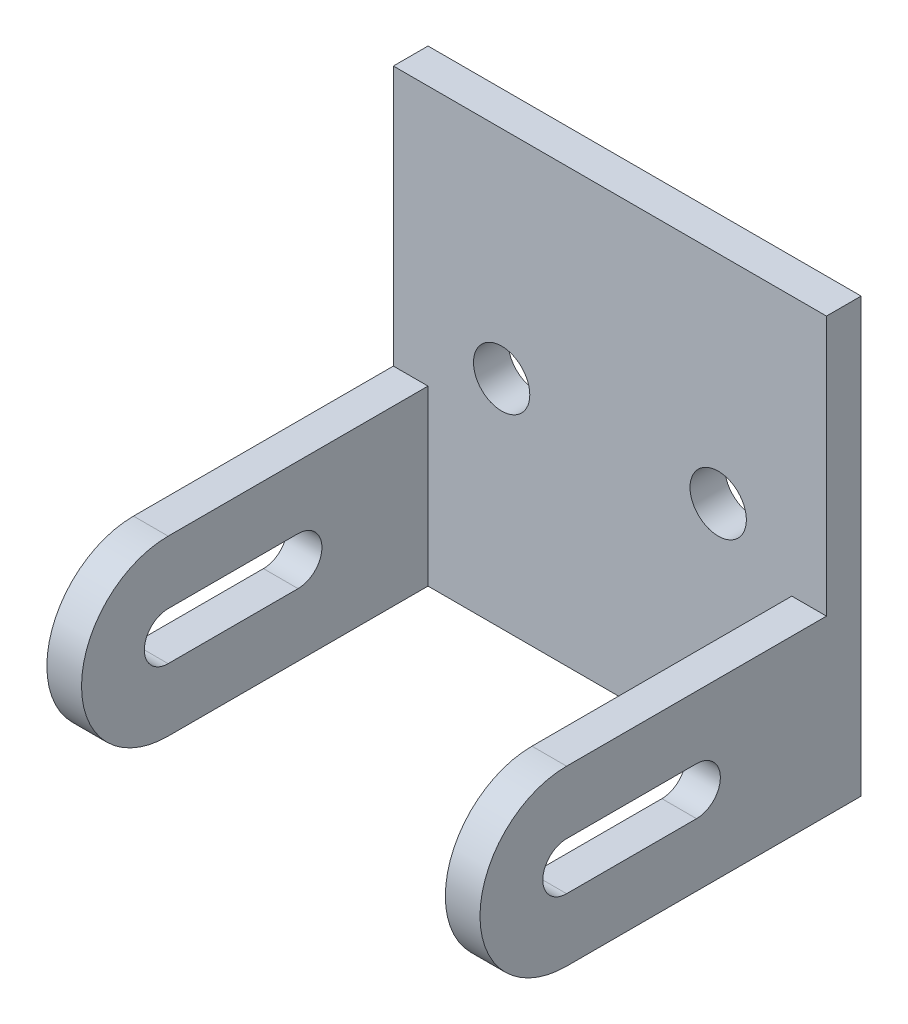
ISO-10303-21;
HEADER;
FILE_DESCRIPTION(('STEP AP214'),'2;1');
FILE_NAME('part.step','',(''),(''),'','','');
FILE_SCHEMA(('AUTOMOTIVE_DESIGN { 1 0 10303 214 1 1 1 1 }'));
ENDSEC;
DATA;
#1=APPLICATION_CONTEXT('core data for automotive mechanical design processes');
#2=APPLICATION_PROTOCOL_DEFINITION('international standard','automotive_design',2000,#1);
#3=PRODUCT_CONTEXT('',#1,'mechanical');
#4=PRODUCT('Part','Part','',(#3));
#5=PRODUCT_RELATED_PRODUCT_CATEGORY('part','',(#4));
#6=PRODUCT_DEFINITION_FORMATION('','',#4);
#7=PRODUCT_DEFINITION_CONTEXT('part definition',#1,'design');
#8=PRODUCT_DEFINITION('design','',#6,#7);
#9=PRODUCT_DEFINITION_SHAPE('','',#8);
#10=(LENGTH_UNIT() NAMED_UNIT(*) SI_UNIT(.MILLI.,.METRE.));
#11=(NAMED_UNIT(*) PLANE_ANGLE_UNIT() SI_UNIT($,.RADIAN.));
#12=(NAMED_UNIT(*) SI_UNIT($,.STERADIAN.) SOLID_ANGLE_UNIT());
#13=UNCERTAINTY_MEASURE_WITH_UNIT(LENGTH_MEASURE(1.E-05),#10,'distance_accuracy_value','');
#14=(GEOMETRIC_REPRESENTATION_CONTEXT(3) GLOBAL_UNCERTAINTY_ASSIGNED_CONTEXT((#13)) GLOBAL_UNIT_ASSIGNED_CONTEXT((#10,
#11,#12)) REPRESENTATION_CONTEXT('',''));
#15=CARTESIAN_POINT('',(0.,0.,0.));
#16=DIRECTION('',(0.,0.,1.));
#17=DIRECTION('',(1.,0.,0.));
#18=AXIS2_PLACEMENT_3D('',#15,#16,#17);
#19=CARTESIAN_POINT('',(0.,0.,4.));
#20=DIRECTION('',(0.,0.,1.));
#21=DIRECTION('',(1.,0.,0.));
#22=AXIS2_PLACEMENT_3D('',#19,#20,#21);
#23=PLANE('',#22);
#24=DIRECTION('',(1.,0.,0.));
#25=VECTOR('',#24,1.);
#26=CARTESIAN_POINT('',(46.,-30.,4.));
#27=LINE('',#26,#25);
#28=CARTESIAN_POINT('',(46.,-30.,4.));
#29=VERTEX_POINT('',#28);
#30=CARTESIAN_POINT('',(50.,-30.,4.));
#31=VERTEX_POINT('',#30);
#32=EDGE_CURVE('E252',#29,#31,#27,.T.);
#33=ORIENTED_EDGE('',*,*,#32,.T.);
#34=DIRECTION('',(0.,1.,0.));
#35=VECTOR('',#34,1.);
#36=CARTESIAN_POINT('',(50.,0.,4.));
#37=LINE('',#36,#35);
#38=CARTESIAN_POINT('',(50.,0.,4.));
#39=VERTEX_POINT('',#38);
#40=EDGE_CURVE('E358',#31,#39,#37,.T.);
#41=ORIENTED_EDGE('',*,*,#40,.T.);
#42=DIRECTION('',(-1.,0.,0.));
#43=VECTOR('',#42,1.);
#44=CARTESIAN_POINT('',(0.,0.,4.));
#45=LINE('',#44,#43);
#46=CARTESIAN_POINT('',(0.,0.,4.));
#47=VERTEX_POINT('',#46);
#48=EDGE_CURVE('E361',#39,#47,#45,.T.);
#49=ORIENTED_EDGE('',*,*,#48,.T.);
#50=DIRECTION('',(0.,-1.,0.));
#51=VECTOR('',#50,1.);
#52=CARTESIAN_POINT('',(0.,0.,4.));
#53=LINE('',#52,#51);
#54=CARTESIAN_POINT('',(0.,-30.,4.));
#55=VERTEX_POINT('',#54);
#56=EDGE_CURVE('E351',#47,#55,#53,.T.);
#57=ORIENTED_EDGE('',*,*,#56,.T.);
#58=DIRECTION('',(-1.,0.,0.));
#59=VECTOR('',#58,1.);
#60=CARTESIAN_POINT('',(4.,-30.,4.));
#61=LINE('',#60,#59);
#62=CARTESIAN_POINT('',(4.,-30.,4.));
#63=VERTEX_POINT('',#62);
#64=EDGE_CURVE('E325',#63,#55,#61,.T.);
#65=ORIENTED_EDGE('',*,*,#64,.F.);
#66=DIRECTION('',(0.,-1.,0.));
#67=VECTOR('',#66,1.);
#68=CARTESIAN_POINT('',(4.00000000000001,-50.,4.));
#69=LINE('',#68,#67);
#70=CARTESIAN_POINT('',(4.00000000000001,-50.,4.));
#71=VERTEX_POINT('',#70);
#72=EDGE_CURVE('E302',#63,#71,#69,.T.);
#73=ORIENTED_EDGE('',*,*,#72,.T.);
#74=DIRECTION('',(1.,0.,0.));
#75=VECTOR('',#74,1.);
#76=CARTESIAN_POINT('',(0.,-50.,4.));
#77=LINE('',#76,#75);
#78=CARTESIAN_POINT('',(46.,-50.,4.));
#79=VERTEX_POINT('',#78);
#80=EDGE_CURVE('E65',#71,#79,#77,.T.);
#81=ORIENTED_EDGE('',*,*,#80,.T.);
#82=DIRECTION('',(0.,1.,0.));
#83=VECTOR('',#82,1.);
#84=CARTESIAN_POINT('',(46.,-30.,4.));
#85=LINE('',#84,#83);
#86=EDGE_CURVE('E60',#79,#29,#85,.T.);
#87=ORIENTED_EDGE('',*,*,#86,.T.);
#88=EDGE_LOOP('',(#33,#41,#49,#57,#65,#73,#81,#87));
#89=FACE_BOUND('',#88,.T.);
#90=CARTESIAN_POINT('',(12.5,-25.,4.));
#91=DIRECTION('',(0.,0.,1.));
#92=DIRECTION('',(1.,0.,0.));
#93=AXIS2_PLACEMENT_3D('',#90,#91,#92);
#94=CIRCLE('',#93,3.25);
#95=CARTESIAN_POINT('',(15.75,-25.,4.));
#96=VERTEX_POINT('',#95);
#97=EDGE_CURVE('E343',#96,#96,#94,.T.);
#98=ORIENTED_EDGE('',*,*,#97,.F.);
#99=EDGE_LOOP('',(#98));
#100=FACE_BOUND('',#99,.T.);
#101=CARTESIAN_POINT('',(37.5,-25.,4.));
#102=DIRECTION('',(0.,0.,1.));
#103=DIRECTION('',(-1.,0.,0.));
#104=AXIS2_PLACEMENT_3D('',#101,#102,#103);
#105=CIRCLE('',#104,3.25);
#106=CARTESIAN_POINT('',(34.25,-25.,4.));
#107=VERTEX_POINT('',#106);
#108=EDGE_CURVE('E335',#107,#107,#105,.T.);
#109=ORIENTED_EDGE('',*,*,#108,.F.);
#110=EDGE_LOOP('',(#109));
#111=FACE_BOUND('',#110,.T.);
#112=ADVANCED_FACE('F44',(#89,#100,#111),#23,.T.);
#113=CARTESIAN_POINT('',(0.,0.,0.));
#114=DIRECTION('',(0.,0.,1.));
#115=DIRECTION('',(1.,0.,0.));
#116=AXIS2_PLACEMENT_3D('',#113,#114,#115);
#117=PLANE('',#116);
#118=DIRECTION('',(0.,-1.,0.));
#119=VECTOR('',#118,1.);
#120=CARTESIAN_POINT('',(0.,0.,0.));
#121=LINE('',#120,#119);
#122=CARTESIAN_POINT('',(0.,0.,0.));
#123=VERTEX_POINT('',#122);
#124=CARTESIAN_POINT('',(0.,-50.,0.));
#125=VERTEX_POINT('',#124);
#126=EDGE_CURVE('E347',#123,#125,#121,.T.);
#127=ORIENTED_EDGE('',*,*,#126,.F.);
#128=DIRECTION('',(-1.,0.,0.));
#129=VECTOR('',#128,1.);
#130=CARTESIAN_POINT('',(0.,0.,0.));
#131=LINE('',#130,#129);
#132=CARTESIAN_POINT('',(50.,0.,0.));
#133=VERTEX_POINT('',#132);
#134=EDGE_CURVE('E355',#133,#123,#131,.T.);
#135=ORIENTED_EDGE('',*,*,#134,.F.);
#136=DIRECTION('',(0.,1.,0.));
#137=VECTOR('',#136,1.);
#138=CARTESIAN_POINT('',(50.,0.,0.));
#139=LINE('',#138,#137);
#140=CARTESIAN_POINT('',(50.,-50.,0.));
#141=VERTEX_POINT('',#140);
#142=EDGE_CURVE('E371',#141,#133,#139,.T.);
#143=ORIENTED_EDGE('',*,*,#142,.F.);
#144=DIRECTION('',(1.,0.,0.));
#145=VECTOR('',#144,1.);
#146=CARTESIAN_POINT('',(0.,-50.,0.));
#147=LINE('',#146,#145);
#148=EDGE_CURVE('E368',#125,#141,#147,.T.);
#149=ORIENTED_EDGE('',*,*,#148,.F.);
#150=EDGE_LOOP('',(#127,#135,#143,#149));
#151=FACE_BOUND('',#150,.T.);
#152=CARTESIAN_POINT('',(12.5,-25.,0.));
#153=DIRECTION('',(0.,0.,1.));
#154=DIRECTION('',(1.,0.,0.));
#155=AXIS2_PLACEMENT_3D('',#152,#153,#154);
#156=CIRCLE('',#155,3.25);
#157=CARTESIAN_POINT('',(15.75,-25.,0.));
#158=VERTEX_POINT('',#157);
#159=EDGE_CURVE('E339',#158,#158,#156,.T.);
#160=ORIENTED_EDGE('',*,*,#159,.T.);
#161=EDGE_LOOP('',(#160));
#162=FACE_BOUND('',#161,.T.);
#163=CARTESIAN_POINT('',(37.5,-25.,0.));
#164=DIRECTION('',(0.,0.,1.));
#165=DIRECTION('',(-1.,0.,0.));
#166=AXIS2_PLACEMENT_3D('',#163,#164,#165);
#167=CIRCLE('',#166,3.25);
#168=CARTESIAN_POINT('',(34.25,-25.,0.));
#169=VERTEX_POINT('',#168);
#170=EDGE_CURVE('E328',#169,#169,#167,.T.);
#171=ORIENTED_EDGE('',*,*,#170,.T.);
#172=EDGE_LOOP('',(#171));
#173=FACE_BOUND('',#172,.T.);
#174=ADVANCED_FACE('F394',(#151,#162,#173),#117,.F.);
#175=CARTESIAN_POINT('',(0.,0.,4.));
#176=DIRECTION('',(1.,0.,0.));
#177=DIRECTION('',(0.,0.,-1.));
#178=AXIS2_PLACEMENT_3D('',#175,#176,#177);
#179=PLANE('',#178);
#180=ORIENTED_EDGE('',*,*,#126,.T.);
#181=DIRECTION('',(0.,0.,-1.));
#182=VECTOR('',#181,1.);
#183=CARTESIAN_POINT('',(0.,-50.,4.));
#184=LINE('',#183,#182);
#185=CARTESIAN_POINT('',(0.,-50.,34.));
#186=VERTEX_POINT('',#185);
#187=EDGE_CURVE('E11',#186,#125,#184,.T.);
#188=ORIENTED_EDGE('',*,*,#187,.F.);
#189=CARTESIAN_POINT('',(0.,-40.,34.));
#190=DIRECTION('',(-1.,0.,0.));
#191=DIRECTION('',(0.,-1.,0.));
#192=AXIS2_PLACEMENT_3D('',#189,#190,#191);
#193=CIRCLE('',#192,10.);
#194=CARTESIAN_POINT('',(0.,-30.,34.));
#195=VERTEX_POINT('',#194);
#196=EDGE_CURVE('E292',#186,#195,#193,.T.);
#197=ORIENTED_EDGE('',*,*,#196,.T.);
#198=DIRECTION('',(0.,0.,-1.));
#199=VECTOR('',#198,1.);
#200=CARTESIAN_POINT('',(0.,-30.,4.));
#201=LINE('',#200,#199);
#202=EDGE_CURVE('E306',#195,#55,#201,.T.);
#203=ORIENTED_EDGE('',*,*,#202,.T.);
#204=ORIENTED_EDGE('',*,*,#56,.F.);
#205=DIRECTION('',(0.,0.,-1.));
#206=VECTOR('',#205,1.);
#207=CARTESIAN_POINT('',(0.,0.,4.));
#208=LINE('',#207,#206);
#209=EDGE_CURVE('E364',#47,#123,#208,.T.);
#210=ORIENTED_EDGE('',*,*,#209,.T.);
#211=EDGE_LOOP('',(#180,#188,#197,#203,#204,#210));
#212=FACE_BOUND('',#211,.T.);
#213=CARTESIAN_POINT('',(0.,-40.,34.));
#214=DIRECTION('',(-1.,0.,0.));
#215=DIRECTION('',(0.,-1.,0.));
#216=AXIS2_PLACEMENT_3D('',#213,#214,#215);
#217=CIRCLE('',#216,2.75);
#218=CARTESIAN_POINT('',(0.,-42.75,34.));
#219=VERTEX_POINT('',#218);
#220=CARTESIAN_POINT('',(0.,-37.25,34.));
#221=VERTEX_POINT('',#220);
#222=EDGE_CURVE('E251',#219,#221,#217,.T.);
#223=ORIENTED_EDGE('',*,*,#222,.F.);
#224=DIRECTION('',(0.,0.,1.));
#225=VECTOR('',#224,1.);
#226=CARTESIAN_POINT('',(0.,-42.75,34.));
#227=LINE('',#226,#225);
#228=CARTESIAN_POINT('',(0.,-42.75,19.));
#229=VERTEX_POINT('',#228);
#230=EDGE_CURVE('E263',#229,#219,#227,.T.);
#231=ORIENTED_EDGE('',*,*,#230,.F.);
#232=CARTESIAN_POINT('',(0.,-40.,19.));
#233=DIRECTION('',(-1.,0.,0.));
#234=DIRECTION('',(0.,-1.,0.));
#235=AXIS2_PLACEMENT_3D('',#232,#233,#234);
#236=CIRCLE('',#235,2.75);
#237=CARTESIAN_POINT('',(0.,-37.25,19.));
#238=VERTEX_POINT('',#237);
#239=EDGE_CURVE('E282',#238,#229,#236,.T.);
#240=ORIENTED_EDGE('',*,*,#239,.F.);
#241=DIRECTION('',(0.,0.,-1.));
#242=VECTOR('',#241,1.);
#243=CARTESIAN_POINT('',(0.,-37.25,34.));
#244=LINE('',#243,#242);
#245=EDGE_CURVE('E278',#221,#238,#244,.T.);
#246=ORIENTED_EDGE('',*,*,#245,.F.);
#247=EDGE_LOOP('',(#223,#231,#240,#246));
#248=FACE_BOUND('',#247,.T.);
#249=ADVANCED_FACE('F46',(#212,#248),#179,.F.);
#250=CARTESIAN_POINT('',(0.,-50.,4.));
#251=DIRECTION('',(0.,1.,0.));
#252=DIRECTION('',(-1.,0.,0.));
#253=AXIS2_PLACEMENT_3D('',#250,#251,#252);
#254=PLANE('',#253);
#255=ORIENTED_EDGE('',*,*,#148,.T.);
#256=DIRECTION('',(0.,0.,-1.));
#257=VECTOR('',#256,1.);
#258=CARTESIAN_POINT('',(50.,-50.,4.));
#259=LINE('',#258,#257);
#260=CARTESIAN_POINT('',(50.,-50.,34.));
#261=VERTEX_POINT('',#260);
#262=EDGE_CURVE('E53',#261,#141,#259,.T.);
#263=ORIENTED_EDGE('',*,*,#262,.F.);
#264=DIRECTION('',(1.,0.,0.));
#265=VECTOR('',#264,1.);
#266=CARTESIAN_POINT('',(46.,-50.,34.));
#267=LINE('',#266,#265);
#268=CARTESIAN_POINT('',(46.,-50.,34.));
#269=VERTEX_POINT('',#268);
#270=EDGE_CURVE('E241',#269,#261,#267,.T.);
#271=ORIENTED_EDGE('',*,*,#270,.F.);
#272=DIRECTION('',(0.,0.,-1.));
#273=VECTOR('',#272,1.);
#274=CARTESIAN_POINT('',(46.,-50.,4.));
#275=LINE('',#274,#273);
#276=EDGE_CURVE('E230',#269,#79,#275,.T.);
#277=ORIENTED_EDGE('',*,*,#276,.T.);
#278=ORIENTED_EDGE('',*,*,#80,.F.);
#279=DIRECTION('',(0.,0.,1.));
#280=VECTOR('',#279,1.);
#281=CARTESIAN_POINT('',(4.00000000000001,-50.,4.));
#282=LINE('',#281,#280);
#283=CARTESIAN_POINT('',(4.00000000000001,-50.,34.));
#284=VERTEX_POINT('',#283);
#285=EDGE_CURVE('E305',#71,#284,#282,.T.);
#286=ORIENTED_EDGE('',*,*,#285,.T.);
#287=DIRECTION('',(-1.,0.,0.));
#288=VECTOR('',#287,1.);
#289=CARTESIAN_POINT('',(4.00000000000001,-50.,34.));
#290=LINE('',#289,#288);
#291=EDGE_CURVE('E318',#284,#186,#290,.T.);
#292=ORIENTED_EDGE('',*,*,#291,.T.);
#293=ORIENTED_EDGE('',*,*,#187,.T.);
#294=EDGE_LOOP('',(#255,#263,#271,#277,#278,#286,#292,#293));
#295=FACE_BOUND('',#294,.T.);
#296=ADVANCED_FACE('F414',(#295),#254,.F.);
#297=CARTESIAN_POINT('',(50.,0.,4.));
#298=DIRECTION('',(-1.,0.,0.));
#299=DIRECTION('',(0.,-1.,0.));
#300=AXIS2_PLACEMENT_3D('',#297,#298,#299);
#301=PLANE('',#300);
#302=ORIENTED_EDGE('',*,*,#142,.T.);
#303=DIRECTION('',(0.,0.,-1.));
#304=VECTOR('',#303,1.);
#305=CARTESIAN_POINT('',(50.,0.,4.));
#306=LINE('',#305,#304);
#307=EDGE_CURVE('E379',#39,#133,#306,.T.);
#308=ORIENTED_EDGE('',*,*,#307,.F.);
#309=ORIENTED_EDGE('',*,*,#40,.F.);
#310=DIRECTION('',(0.,0.,1.));
#311=VECTOR('',#310,1.);
#312=CARTESIAN_POINT('',(50.,-30.,34.));
#313=LINE('',#312,#311);
#314=CARTESIAN_POINT('',(50.,-30.,34.));
#315=VERTEX_POINT('',#314);
#316=EDGE_CURVE('E231',#31,#315,#313,.T.);
#317=ORIENTED_EDGE('',*,*,#316,.T.);
#318=CARTESIAN_POINT('',(50.,-40.,34.));
#319=DIRECTION('',(1.,0.,0.));
#320=DIRECTION('',(0.,-1.,0.));
#321=AXIS2_PLACEMENT_3D('',#318,#319,#320);
#322=CIRCLE('',#321,10.);
#323=EDGE_CURVE('E220',#315,#261,#322,.T.);
#324=ORIENTED_EDGE('',*,*,#323,.T.);
#325=ORIENTED_EDGE('',*,*,#262,.T.);
#326=EDGE_LOOP('',(#302,#308,#309,#317,#324,#325));
#327=FACE_BOUND('',#326,.T.);
#328=DIRECTION('',(0.,0.,-1.));
#329=VECTOR('',#328,1.);
#330=CARTESIAN_POINT('',(50.,-42.75,34.));
#331=LINE('',#330,#329);
#332=CARTESIAN_POINT('',(50.,-42.75,34.));
#333=VERTEX_POINT('',#332);
#334=CARTESIAN_POINT('',(50.,-42.75,19.));
#335=VERTEX_POINT('',#334);
#336=EDGE_CURVE('E211',#333,#335,#331,.T.);
#337=ORIENTED_EDGE('',*,*,#336,.F.);
#338=CARTESIAN_POINT('',(50.,-40.,34.));
#339=DIRECTION('',(1.,0.,0.));
#340=DIRECTION('',(0.,1.,0.));
#341=AXIS2_PLACEMENT_3D('',#338,#339,#340);
#342=CIRCLE('',#341,2.75000000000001);
#343=CARTESIAN_POINT('',(50.,-37.25,34.));
#344=VERTEX_POINT('',#343);
#345=EDGE_CURVE('E177',#344,#333,#342,.T.);
#346=ORIENTED_EDGE('',*,*,#345,.F.);
#347=DIRECTION('',(0.,0.,1.));
#348=VECTOR('',#347,1.);
#349=CARTESIAN_POINT('',(50.,-37.25,34.));
#350=LINE('',#349,#348);
#351=CARTESIAN_POINT('',(50.,-37.25,19.));
#352=VERTEX_POINT('',#351);
#353=EDGE_CURVE('E198',#352,#344,#350,.T.);
#354=ORIENTED_EDGE('',*,*,#353,.F.);
#355=CARTESIAN_POINT('',(50.,-40.,19.));
#356=DIRECTION('',(1.,0.,0.));
#357=DIRECTION('',(0.,1.,0.));
#358=AXIS2_PLACEMENT_3D('',#355,#356,#357);
#359=CIRCLE('',#358,2.75000000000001);
#360=EDGE_CURVE('E202',#335,#352,#359,.T.);
#361=ORIENTED_EDGE('',*,*,#360,.F.);
#362=EDGE_LOOP('',(#337,#346,#354,#361));
#363=FACE_BOUND('',#362,.T.);
#364=ADVANCED_FACE('F386',(#327,#363),#301,.F.);
#365=CARTESIAN_POINT('',(0.,0.,4.));
#366=DIRECTION('',(0.,-1.,0.));
#367=DIRECTION('',(0.,0.,-1.));
#368=AXIS2_PLACEMENT_3D('',#365,#366,#367);
#369=PLANE('',#368);
#370=ORIENTED_EDGE('',*,*,#134,.T.);
#371=ORIENTED_EDGE('',*,*,#209,.F.);
#372=ORIENTED_EDGE('',*,*,#48,.F.);
#373=ORIENTED_EDGE('',*,*,#307,.T.);
#374=EDGE_LOOP('',(#370,#371,#372,#373));
#375=FACE_BOUND('',#374,.T.);
#376=ADVANCED_FACE('F398',(#375),#369,.F.);
#377=CARTESIAN_POINT('',(12.5,-25.,4.));
#378=DIRECTION('',(0.,0.,-1.));
#379=DIRECTION('',(-1.,0.,0.));
#380=AXIS2_PLACEMENT_3D('',#377,#378,#379);
#381=CYLINDRICAL_SURFACE('',#380,3.25);
#382=ORIENTED_EDGE('',*,*,#97,.T.);
#383=EDGE_LOOP('',(#382));
#384=FACE_BOUND('',#383,.T.);
#385=ORIENTED_EDGE('',*,*,#159,.F.);
#386=EDGE_LOOP('',(#385));
#387=FACE_BOUND('',#386,.T.);
#388=ADVANCED_FACE('F431',(#384,#387),#381,.F.);
#389=CARTESIAN_POINT('',(37.5,-25.,4.));
#390=DIRECTION('',(0.,0.,-1.));
#391=DIRECTION('',(-1.,0.,0.));
#392=AXIS2_PLACEMENT_3D('',#389,#390,#391);
#393=CYLINDRICAL_SURFACE('',#392,3.25);
#394=ORIENTED_EDGE('',*,*,#108,.T.);
#395=EDGE_LOOP('',(#394));
#396=FACE_BOUND('',#395,.T.);
#397=ORIENTED_EDGE('',*,*,#170,.F.);
#398=EDGE_LOOP('',(#397));
#399=FACE_BOUND('',#398,.T.);
#400=ADVANCED_FACE('F468',(#396,#399),#393,.F.);
#401=CARTESIAN_POINT('',(4.,-30.,4.));
#402=DIRECTION('',(0.,1.,0.));
#403=DIRECTION('',(-1.,0.,0.));
#404=AXIS2_PLACEMENT_3D('',#401,#402,#403);
#405=PLANE('',#404);
#406=ORIENTED_EDGE('',*,*,#202,.F.);
#407=DIRECTION('',(-1.,0.,0.));
#408=VECTOR('',#407,1.);
#409=CARTESIAN_POINT('',(4.,-30.,34.));
#410=LINE('',#409,#408);
#411=CARTESIAN_POINT('',(4.,-30.,34.));
#412=VERTEX_POINT('',#411);
#413=EDGE_CURVE('E329',#412,#195,#410,.T.);
#414=ORIENTED_EDGE('',*,*,#413,.F.);
#415=DIRECTION('',(0.,0.,-1.));
#416=VECTOR('',#415,1.);
#417=CARTESIAN_POINT('',(4.,-30.,4.));
#418=LINE('',#417,#416);
#419=EDGE_CURVE('E314',#412,#63,#418,.T.);
#420=ORIENTED_EDGE('',*,*,#419,.T.);
#421=ORIENTED_EDGE('',*,*,#64,.T.);
#422=EDGE_LOOP('',(#406,#414,#420,#421));
#423=FACE_BOUND('',#422,.T.);
#424=ADVANCED_FACE('F477',(#423),#405,.T.);
#425=CARTESIAN_POINT('',(4.00000000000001,-40.,34.));
#426=DIRECTION('',(-1.,0.,0.));
#427=DIRECTION('',(0.,-1.,0.));
#428=AXIS2_PLACEMENT_3D('',#425,#426,#427);
#429=CYLINDRICAL_SURFACE('',#428,10.);
#430=ORIENTED_EDGE('',*,*,#196,.F.);
#431=ORIENTED_EDGE('',*,*,#291,.F.);
#432=CARTESIAN_POINT('',(4.00000000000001,-40.,34.));
#433=DIRECTION('',(-1.,0.,0.));
#434=DIRECTION('',(0.,-1.,0.));
#435=AXIS2_PLACEMENT_3D('',#432,#433,#434);
#436=CIRCLE('',#435,10.);
#437=EDGE_CURVE('E310',#284,#412,#436,.T.);
#438=ORIENTED_EDGE('',*,*,#437,.T.);
#439=ORIENTED_EDGE('',*,*,#413,.T.);
#440=EDGE_LOOP('',(#430,#431,#438,#439));
#441=FACE_BOUND('',#440,.T.);
#442=ADVANCED_FACE('F486',(#441),#429,.T.);
#443=CARTESIAN_POINT('',(4.00000000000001,-40.,34.));
#444=DIRECTION('',(-1.,0.,0.));
#445=DIRECTION('',(0.,-1.,0.));
#446=AXIS2_PLACEMENT_3D('',#443,#444,#445);
#447=PLANE('',#446);
#448=DIRECTION('',(0.,0.,1.));
#449=VECTOR('',#448,1.);
#450=CARTESIAN_POINT('',(4.00000000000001,-42.75,34.));
#451=LINE('',#450,#449);
#452=CARTESIAN_POINT('',(4.00000000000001,-42.75,19.));
#453=VERTEX_POINT('',#452);
#454=CARTESIAN_POINT('',(4.00000000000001,-42.75,34.));
#455=VERTEX_POINT('',#454);
#456=EDGE_CURVE('E271',#453,#455,#451,.T.);
#457=ORIENTED_EDGE('',*,*,#456,.T.);
#458=CARTESIAN_POINT('',(4.00000000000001,-40.,34.));
#459=DIRECTION('',(-1.,0.,0.));
#460=DIRECTION('',(0.,-1.,0.));
#461=AXIS2_PLACEMENT_3D('',#458,#459,#460);
#462=CIRCLE('',#461,2.75);
#463=CARTESIAN_POINT('',(4.,-37.25,34.));
#464=VERTEX_POINT('',#463);
#465=EDGE_CURVE('E258',#455,#464,#462,.T.);
#466=ORIENTED_EDGE('',*,*,#465,.T.);
#467=DIRECTION('',(0.,0.,-1.));
#468=VECTOR('',#467,1.);
#469=CARTESIAN_POINT('',(4.,-37.25,34.));
#470=LINE('',#469,#468);
#471=CARTESIAN_POINT('',(4.00000000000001,-37.25,19.));
#472=VERTEX_POINT('',#471);
#473=EDGE_CURVE('E262',#464,#472,#470,.T.);
#474=ORIENTED_EDGE('',*,*,#473,.T.);
#475=CARTESIAN_POINT('',(4.00000000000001,-40.,19.));
#476=DIRECTION('',(-1.,0.,0.));
#477=DIRECTION('',(0.,-1.,0.));
#478=AXIS2_PLACEMENT_3D('',#475,#476,#477);
#479=CIRCLE('',#478,2.75);
#480=EDGE_CURVE('E267',#472,#453,#479,.T.);
#481=ORIENTED_EDGE('',*,*,#480,.T.);
#482=EDGE_LOOP('',(#457,#466,#474,#481));
#483=FACE_BOUND('',#482,.T.);
#484=ORIENTED_EDGE('',*,*,#72,.F.);
#485=ORIENTED_EDGE('',*,*,#419,.F.);
#486=ORIENTED_EDGE('',*,*,#437,.F.);
#487=ORIENTED_EDGE('',*,*,#285,.F.);
#488=EDGE_LOOP('',(#484,#485,#486,#487));
#489=FACE_BOUND('',#488,.T.);
#490=ADVANCED_FACE('F494',(#483,#489),#447,.F.);
#491=CARTESIAN_POINT('',(4.00000000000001,-40.,34.));
#492=DIRECTION('',(-1.,0.,0.));
#493=DIRECTION('',(0.,-1.,0.));
#494=AXIS2_PLACEMENT_3D('',#491,#492,#493);
#495=CYLINDRICAL_SURFACE('',#494,2.75);
#496=ORIENTED_EDGE('',*,*,#222,.T.);
#497=DIRECTION('',(-1.,0.,0.));
#498=VECTOR('',#497,1.);
#499=CARTESIAN_POINT('',(4.,-37.25,34.));
#500=LINE('',#499,#498);
#501=EDGE_CURVE('E275',#464,#221,#500,.T.);
#502=ORIENTED_EDGE('',*,*,#501,.F.);
#503=ORIENTED_EDGE('',*,*,#465,.F.);
#504=DIRECTION('',(-1.,0.,0.));
#505=VECTOR('',#504,1.);
#506=CARTESIAN_POINT('',(4.00000000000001,-42.75,34.));
#507=LINE('',#506,#505);
#508=EDGE_CURVE('E289',#455,#219,#507,.T.);
#509=ORIENTED_EDGE('',*,*,#508,.T.);
#510=EDGE_LOOP('',(#496,#502,#503,#509));
#511=FACE_BOUND('',#510,.T.);
#512=ADVANCED_FACE('F502',(#511),#495,.F.);
#513=CARTESIAN_POINT('',(4.00000000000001,-42.75,34.));
#514=DIRECTION('',(0.,-1.,0.));
#515=DIRECTION('',(1.,0.,0.));
#516=AXIS2_PLACEMENT_3D('',#513,#514,#515);
#517=PLANE('',#516);
#518=ORIENTED_EDGE('',*,*,#230,.T.);
#519=ORIENTED_EDGE('',*,*,#508,.F.);
#520=ORIENTED_EDGE('',*,*,#456,.F.);
#521=DIRECTION('',(-1.,0.,0.));
#522=VECTOR('',#521,1.);
#523=CARTESIAN_POINT('',(4.00000000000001,-42.75,19.));
#524=LINE('',#523,#522);
#525=EDGE_CURVE('E293',#453,#229,#524,.T.);
#526=ORIENTED_EDGE('',*,*,#525,.T.);
#527=EDGE_LOOP('',(#518,#519,#520,#526));
#528=FACE_BOUND('',#527,.T.);
#529=ADVANCED_FACE('F510',(#528),#517,.F.);
#530=CARTESIAN_POINT('',(4.00000000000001,-40.,19.));
#531=DIRECTION('',(-1.,0.,0.));
#532=DIRECTION('',(0.,-1.,0.));
#533=AXIS2_PLACEMENT_3D('',#530,#531,#532);
#534=CYLINDRICAL_SURFACE('',#533,2.75);
#535=ORIENTED_EDGE('',*,*,#239,.T.);
#536=ORIENTED_EDGE('',*,*,#525,.F.);
#537=ORIENTED_EDGE('',*,*,#480,.F.);
#538=DIRECTION('',(-1.,0.,0.));
#539=VECTOR('',#538,1.);
#540=CARTESIAN_POINT('',(4.,-37.25,19.));
#541=LINE('',#540,#539);
#542=EDGE_CURVE('E296',#472,#238,#541,.T.);
#543=ORIENTED_EDGE('',*,*,#542,.T.);
#544=EDGE_LOOP('',(#535,#536,#537,#543));
#545=FACE_BOUND('',#544,.T.);
#546=ADVANCED_FACE('F518',(#545),#534,.F.);
#547=CARTESIAN_POINT('',(4.,-37.25,34.));
#548=DIRECTION('',(0.,1.,0.));
#549=DIRECTION('',(0.,0.,1.));
#550=AXIS2_PLACEMENT_3D('',#547,#548,#549);
#551=PLANE('',#550);
#552=ORIENTED_EDGE('',*,*,#245,.T.);
#553=ORIENTED_EDGE('',*,*,#542,.F.);
#554=ORIENTED_EDGE('',*,*,#473,.F.);
#555=ORIENTED_EDGE('',*,*,#501,.T.);
#556=EDGE_LOOP('',(#552,#553,#554,#555));
#557=FACE_BOUND('',#556,.T.);
#558=ADVANCED_FACE('F526',(#557),#551,.F.);
#559=CARTESIAN_POINT('',(46.,-40.,34.));
#560=DIRECTION('',(1.,0.,0.));
#561=DIRECTION('',(0.,1.,0.));
#562=AXIS2_PLACEMENT_3D('',#559,#560,#561);
#563=CYLINDRICAL_SURFACE('',#562,10.);
#564=ORIENTED_EDGE('',*,*,#323,.F.);
#565=DIRECTION('',(1.,0.,0.));
#566=VECTOR('',#565,1.);
#567=CARTESIAN_POINT('',(46.,-30.,34.));
#568=LINE('',#567,#566);
#569=CARTESIAN_POINT('',(46.,-30.,34.));
#570=VERTEX_POINT('',#569);
#571=EDGE_CURVE('E248',#570,#315,#568,.T.);
#572=ORIENTED_EDGE('',*,*,#571,.F.);
#573=CARTESIAN_POINT('',(46.,-40.,34.));
#574=DIRECTION('',(1.,0.,0.));
#575=DIRECTION('',(0.,-1.,0.));
#576=AXIS2_PLACEMENT_3D('',#573,#574,#575);
#577=CIRCLE('',#576,10.);
#578=EDGE_CURVE('E226',#570,#269,#577,.T.);
#579=ORIENTED_EDGE('',*,*,#578,.T.);
#580=ORIENTED_EDGE('',*,*,#270,.T.);
#581=EDGE_LOOP('',(#564,#572,#579,#580));
#582=FACE_BOUND('',#581,.T.);
#583=ADVANCED_FACE('F412',(#582),#563,.T.);
#584=CARTESIAN_POINT('',(46.,-30.,34.));
#585=DIRECTION('',(0.,1.,0.));
#586=DIRECTION('',(-1.,0.,0.));
#587=AXIS2_PLACEMENT_3D('',#584,#585,#586);
#588=PLANE('',#587);
#589=ORIENTED_EDGE('',*,*,#316,.F.);
#590=ORIENTED_EDGE('',*,*,#32,.F.);
#591=DIRECTION('',(0.,0.,1.));
#592=VECTOR('',#591,1.);
#593=CARTESIAN_POINT('',(46.,-30.,34.));
#594=LINE('',#593,#592);
#595=EDGE_CURVE('E237',#29,#570,#594,.T.);
#596=ORIENTED_EDGE('',*,*,#595,.T.);
#597=ORIENTED_EDGE('',*,*,#571,.T.);
#598=EDGE_LOOP('',(#589,#590,#596,#597));
#599=FACE_BOUND('',#598,.T.);
#600=ADVANCED_FACE('F408',(#599),#588,.T.);
#601=CARTESIAN_POINT('',(46.,-40.,34.));
#602=DIRECTION('',(-1.,0.,0.));
#603=DIRECTION('',(0.,-1.,0.));
#604=AXIS2_PLACEMENT_3D('',#601,#602,#603);
#605=PLANE('',#604);
#606=CARTESIAN_POINT('',(46.,-40.,34.));
#607=DIRECTION('',(1.,0.,0.));
#608=DIRECTION('',(0.,1.,0.));
#609=AXIS2_PLACEMENT_3D('',#606,#607,#608);
#610=CIRCLE('',#609,2.75000000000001);
#611=CARTESIAN_POINT('',(46.,-37.25,34.));
#612=VERTEX_POINT('',#611);
#613=CARTESIAN_POINT('',(46.,-42.75,34.));
#614=VERTEX_POINT('',#613);
#615=EDGE_CURVE('E174',#612,#614,#610,.T.);
#616=ORIENTED_EDGE('',*,*,#615,.T.);
#617=DIRECTION('',(0.,0.,-1.));
#618=VECTOR('',#617,1.);
#619=CARTESIAN_POINT('',(46.,-42.75,34.));
#620=LINE('',#619,#618);
#621=CARTESIAN_POINT('',(46.,-42.75,19.));
#622=VERTEX_POINT('',#621);
#623=EDGE_CURVE('E187',#614,#622,#620,.T.);
#624=ORIENTED_EDGE('',*,*,#623,.T.);
#625=CARTESIAN_POINT('',(46.,-40.,19.));
#626=DIRECTION('',(1.,0.,0.));
#627=DIRECTION('',(0.,1.,0.));
#628=AXIS2_PLACEMENT_3D('',#625,#626,#627);
#629=CIRCLE('',#628,2.75000000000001);
#630=CARTESIAN_POINT('',(46.,-37.25,19.));
#631=VERTEX_POINT('',#630);
#632=EDGE_CURVE('E192',#622,#631,#629,.T.);
#633=ORIENTED_EDGE('',*,*,#632,.T.);
#634=DIRECTION('',(0.,0.,1.));
#635=VECTOR('',#634,1.);
#636=CARTESIAN_POINT('',(46.,-37.25,34.));
#637=LINE('',#636,#635);
#638=EDGE_CURVE('E183',#631,#612,#637,.T.);
#639=ORIENTED_EDGE('',*,*,#638,.T.);
#640=EDGE_LOOP('',(#616,#624,#633,#639));
#641=FACE_BOUND('',#640,.T.);
#642=ORIENTED_EDGE('',*,*,#578,.F.);
#643=ORIENTED_EDGE('',*,*,#595,.F.);
#644=ORIENTED_EDGE('',*,*,#86,.F.);
#645=ORIENTED_EDGE('',*,*,#276,.F.);
#646=EDGE_LOOP('',(#642,#643,#644,#645));
#647=FACE_BOUND('',#646,.T.);
#648=ADVANCED_FACE('F194',(#641,#647),#605,.T.);
#649=CARTESIAN_POINT('',(46.,-40.,34.));
#650=DIRECTION('',(1.,0.,0.));
#651=DIRECTION('',(0.,1.,0.));
#652=AXIS2_PLACEMENT_3D('',#649,#650,#651);
#653=CYLINDRICAL_SURFACE('',#652,2.75000000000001);
#654=ORIENTED_EDGE('',*,*,#345,.T.);
#655=DIRECTION('',(1.,0.,0.));
#656=VECTOR('',#655,1.);
#657=CARTESIAN_POINT('',(46.,-42.75,34.));
#658=LINE('',#657,#656);
#659=EDGE_CURVE('E170',#614,#333,#658,.T.);
#660=ORIENTED_EDGE('',*,*,#659,.F.);
#661=ORIENTED_EDGE('',*,*,#615,.F.);
#662=DIRECTION('',(1.,0.,0.));
#663=VECTOR('',#662,1.);
#664=CARTESIAN_POINT('',(46.,-37.25,34.));
#665=LINE('',#664,#663);
#666=EDGE_CURVE('E217',#612,#344,#665,.T.);
#667=ORIENTED_EDGE('',*,*,#666,.T.);
#668=EDGE_LOOP('',(#654,#660,#661,#667));
#669=FACE_BOUND('',#668,.T.);
#670=ADVANCED_FACE('F172',(#669),#653,.F.);
#671=CARTESIAN_POINT('',(46.,-37.25,34.));
#672=DIRECTION('',(0.,1.,0.));
#673=DIRECTION('',(-1.,0.,0.));
#674=AXIS2_PLACEMENT_3D('',#671,#672,#673);
#675=PLANE('',#674);
#676=ORIENTED_EDGE('',*,*,#353,.T.);
#677=ORIENTED_EDGE('',*,*,#666,.F.);
#678=ORIENTED_EDGE('',*,*,#638,.F.);
#679=DIRECTION('',(1.,0.,0.));
#680=VECTOR('',#679,1.);
#681=CARTESIAN_POINT('',(46.,-37.25,19.));
#682=LINE('',#681,#680);
#683=EDGE_CURVE('E221',#631,#352,#682,.T.);
#684=ORIENTED_EDGE('',*,*,#683,.T.);
#685=EDGE_LOOP('',(#676,#677,#678,#684));
#686=FACE_BOUND('',#685,.T.);
#687=ADVANCED_FACE('F421',(#686),#675,.F.);
#688=CARTESIAN_POINT('',(46.,-40.,19.));
#689=DIRECTION('',(1.,0.,0.));
#690=DIRECTION('',(0.,1.,0.));
#691=AXIS2_PLACEMENT_3D('',#688,#689,#690);
#692=CYLINDRICAL_SURFACE('',#691,2.75000000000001);
#693=ORIENTED_EDGE('',*,*,#360,.T.);
#694=ORIENTED_EDGE('',*,*,#683,.F.);
#695=ORIENTED_EDGE('',*,*,#632,.F.);
#696=DIRECTION('',(1.,0.,0.));
#697=VECTOR('',#696,1.);
#698=CARTESIAN_POINT('',(46.,-42.75,19.));
#699=LINE('',#698,#697);
#700=EDGE_CURVE('E182',#622,#335,#699,.T.);
#701=ORIENTED_EDGE('',*,*,#700,.T.);
#702=EDGE_LOOP('',(#693,#694,#695,#701));
#703=FACE_BOUND('',#702,.T.);
#704=ADVANCED_FACE('F568',(#703),#692,.F.);
#705=CARTESIAN_POINT('',(46.,-42.75,34.));
#706=DIRECTION('',(0.,-1.,0.));
#707=DIRECTION('',(1.,0.,0.));
#708=AXIS2_PLACEMENT_3D('',#705,#706,#707);
#709=PLANE('',#708);
#710=ORIENTED_EDGE('',*,*,#336,.T.);
#711=ORIENTED_EDGE('',*,*,#700,.F.);
#712=ORIENTED_EDGE('',*,*,#623,.F.);
#713=ORIENTED_EDGE('',*,*,#659,.T.);
#714=EDGE_LOOP('',(#710,#711,#712,#713));
#715=FACE_BOUND('',#714,.T.);
#716=ADVANCED_FACE('F188',(#715),#709,.F.);
#717=CLOSED_SHELL('',(#112,#174,#249,#296,#364,#376,#388,#400,#424,#442,#490,#512,#529,#546,
#558,#583,#600,#648,#670,#687,#704,#716));
#718=MANIFOLD_SOLID_BREP('B2',#717);
#719=ADVANCED_BREP_SHAPE_REPRESENTATION('',(#18,#718),#14);
#720=SHAPE_DEFINITION_REPRESENTATION(#9,#719);
ENDSEC;
END-ISO-10303-21;
